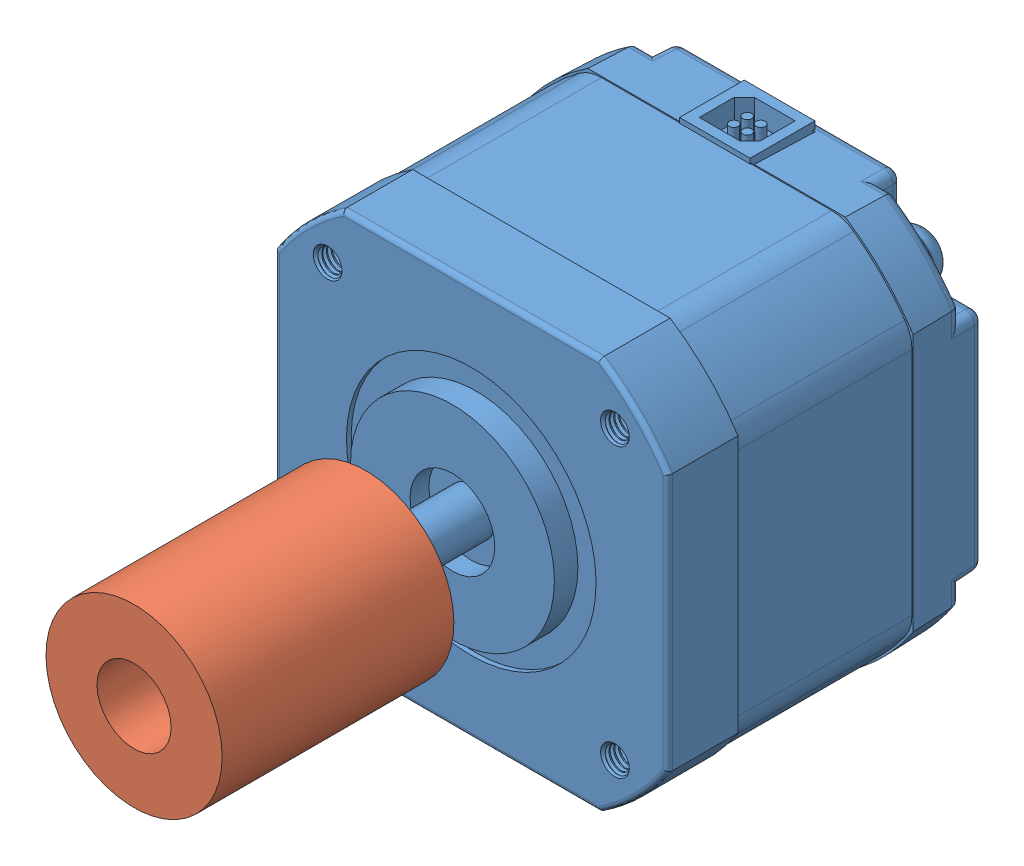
SolidWorks assembly X Axis Drive.sldasm, configuration Default (file format 8000). Lengths in mm.
Overall size (42.42 42.97 540.77).
3 component instances, 3 part files, 4 mates.
Components (placement in the parent):
- 6627T660_POSITION-CONTROL DC MOTOR-1: 6627T660_POSITION-CONTROL DC MOTOR.SLDPRT [6627T66] at origin size (42.42 42.97 58.17)
- 5mm to 8mm coupler-1: 5mm to 8mm coupler.SLDPRT [Default] at (0 0 11.376) x (-0.740356 0.672215 0) z (0.672215 0.740356 0) size (19 25 19)
- 8mm Rod X Axis-1: 8mm Rod X Axis.SLDPRT [Default] at (0 0 23.876) x (0 1 0) z (1 0 0) size (8 482.6 8)
Mates (geometry in assembly coordinates):
- Concentric18: concentric anti-aligned: cylinder of 6627T660_POSITION-CONTROL DC MOTOR-1 through (0 0 23.876) axis (0 0 1) radius 2.4956; cylinder of 5mm to 8mm coupler-1 through (0 0 36.376) axis (0 0 -1) radius 2.5
- Coincident290: coincident aligned: plane of 6627T660_POSITION-CONTROL DC MOTOR-1 through (0 2.4956 23.876) normal (0 0 1); circle of 5mm to 8mm coupler-1
- Concentric21: concentric anti-aligned: cylinder of 5mm to 8mm coupler-1 through (0 0 23.876) axis (0 0 1) radius 4; cylinder of 8mm Rod X Axis-1 through (0 0 506.476) axis (0 0 -1) radius 4
- Coincident301: coincident aligned: plane of 5mm to 8mm coupler-1 through (0 0 23.876) normal (0 0 1); circle of 8mm Rod X Axis-1
